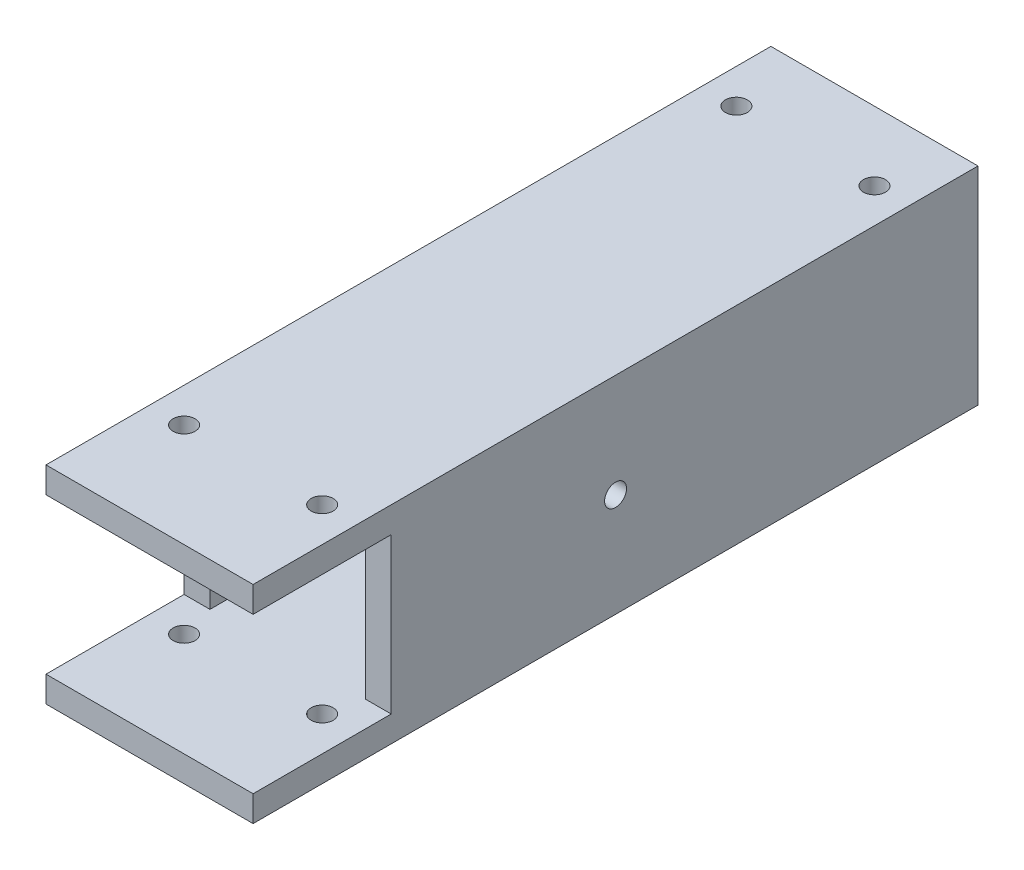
from build123d import *

# Parameters (mm, degrees)
SKETCH1_W                       = 38.1
SKETCH1_H                       = 133.35
BOSS_EXTRUDE1_DEPTH             = 19.05
SKETCH2_W                       = 28.575
SKETCH2_H                       = 28.575
CUT_EXTRUDE1_DEPTH              = 137.044211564
SKETCH3_W                       = 25.4
SKETCH3_H                       = 28.575
CUT_EXTRUDE2_DEPTH              = 80.120592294
F_10_32_TAPPED_HOLE1_AT_2_COUNT = 2
F_10_32_TAPPED_HOLE1_AT_2_PITCH = 25.4
F_10_32_TAPPED_HOLE1_AT_3_COUNT = 2
F_10_32_TAPPED_HOLE1_AT_3_PITCH = 101.6
F_10_32_TAPPED_HOLE1_AT_4_COUNT = 2
F_10_32_TAPPED_HOLE1_AT_4_PITCH = 104.726882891
F_10_32_TAPPED_HOLE2_D          = 4.0386


with BuildPart() as part:
    # Sketch1 → Boss-Extrude1 (new, symmetric)
    with BuildSketch(Plane(origin=(0, 0, 0), x_dir=(1, 0, 0), z_dir=(0, 1, 0))):
        Rectangle(SKETCH1_W, SKETCH1_H)
    extrude(amount=BOSS_EXTRUDE1_DEPTH, both=True)

    # Sketch2 → Cut-Extrude1 (cut, through all)
    with BuildSketch(Plane.XY.offset(66.675)):
        Rectangle(SKETCH2_W, SKETCH2_H)
    extrude(amount=-CUT_EXTRUDE1_DEPTH, mode=Mode.SUBTRACT)

    # Sketch3 → Cut-Extrude2 (cut, through all)
    with BuildSketch(Plane(origin=(19.05, 0, 0), x_dir=(0, 0, -1), z_dir=(1, 0, 0))):
        with Locations((-53.975, 0)):
            Rectangle(SKETCH3_W, SKETCH3_H)
    extrude(amount=-CUT_EXTRUDE2_DEPTH, mode=Mode.SUBTRACT)

    # Sketch4 → 10-32 Tapped Hole1 (revolve, cut)
    with BuildSketch(Plane(origin=(-12.7, 19.05, 47.625), x_dir=(0, 0, 1), z_dir=(1, 0, 0))):
        Polygon((0, 0), (0, 12.389317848), (2.0193, 11.176), (2.0193, 0), align=None)
    f_10_32_tapped_hole1 = revolve(axis=Axis((-12.7, 25.4, 47.625), (0, -1, 0)), mode=Mode.SUBTRACT)

    # 10-32 Tapped Hole1 at 2: 10-32 Tapped Hole1 ×2
    with Locations(*[(i * F_10_32_TAPPED_HOLE1_AT_2_PITCH, 0, 0) for i in range(1, F_10_32_TAPPED_HOLE1_AT_2_COUNT)]):
        add(f_10_32_tapped_hole1, mode=Mode.SUBTRACT)

    # 10-32 Tapped Hole1 at 3: 10-32 Tapped Hole1 ×2
    with Locations(*[(0, 0, -i * F_10_32_TAPPED_HOLE1_AT_3_PITCH) for i in range(1, F_10_32_TAPPED_HOLE1_AT_3_COUNT)]):
        add(f_10_32_tapped_hole1, mode=Mode.SUBTRACT)

    # 10-32 Tapped Hole1 at 4: 10-32 Tapped Hole1 ×2
    with Locations(*[Vector(0.2425356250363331, 0, -0.9701425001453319) * (i * F_10_32_TAPPED_HOLE1_AT_4_PITCH) for i in range(1, F_10_32_TAPPED_HOLE1_AT_4_COUNT)]):
        add(f_10_32_tapped_hole1, mode=Mode.SUBTRACT)

    # 10-32 Tapped Hole2 (through all)
    with Locations(Plane(origin=(19.05, 0, 0), x_dir=(0, 0, -1), z_dir=(1, 0, 0))):
        with Locations((0, 0)):
            Hole(F_10_32_TAPPED_HOLE2_D / 2)

    # Mirror1: 10-32 Tapped Hole1 across plane
    add(f_10_32_tapped_hole1.mirror(Plane.ZX), mode=Mode.SUBTRACT)

    # Mirror1 copy 1 sketch → Mirror1 copy 1 (revolve, cut)
    with BuildSketch(Plane(origin=(12.7, -19.05, 47.625), x_dir=(0, 0, 1), z_dir=(1, 0, 0))):
        Polygon((0, 0), (0, -12.389317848), (2.0193, -11.176), (2.0193, 0), align=None)
    revolve(axis=Axis((12.7, -25.4, 47.625), (0, -1, 0)), mode=Mode.SUBTRACT)

    # Mirror1 copy 2 sketch → Mirror1 copy 2 (revolve, cut)
    with BuildSketch(Plane(origin=(-12.7, -19.05, -53.975), x_dir=(0, 0, 1), z_dir=(1, 0, 0))):
        Polygon((0, 0), (0, -12.389317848), (2.0193, -11.176), (2.0193, 0), align=None)
    revolve(axis=Axis((-12.7, -25.4, -53.975), (0, -1, 0)), mode=Mode.SUBTRACT)

    # Mirror1 copy 3 sketch → Mirror1 copy 3 (revolve, cut)
    with BuildSketch(Plane(origin=(12.7, -19.05, -53.975), x_dir=(0, 0, 1), z_dir=(1, 0, 0))):
        Polygon((0, 0), (0, -12.389317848), (2.0193, -11.176), (2.0193, 0), align=None)
    revolve(axis=Axis((12.7, -25.4, -53.975), (0, -1, 0)), mode=Mode.SUBTRACT)


solid = part.part
